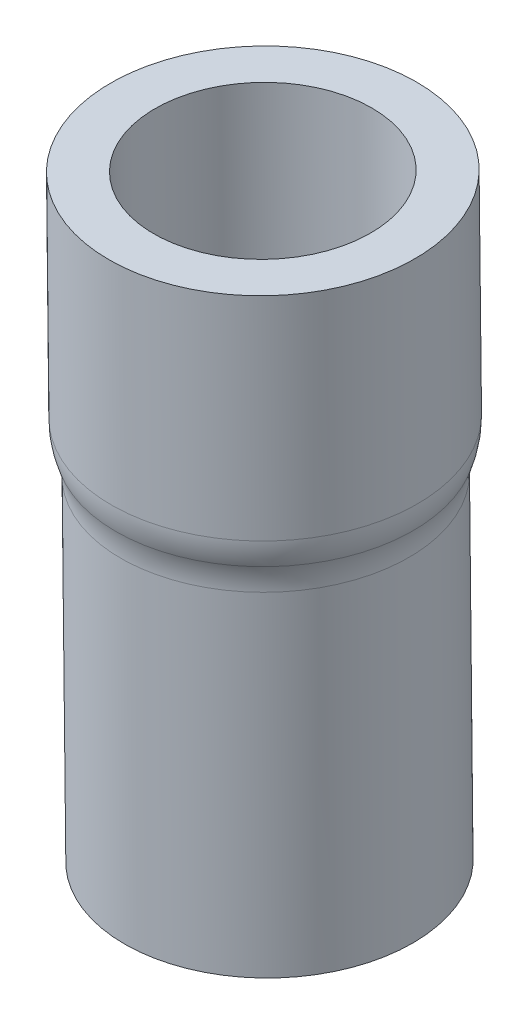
ISO-10303-21;
HEADER;
FILE_DESCRIPTION(('STEP AP214'),'2;1');
FILE_NAME('part.step','',(''),(''),'','','');
FILE_SCHEMA(('AUTOMOTIVE_DESIGN { 1 0 10303 214 1 1 1 1 }'));
ENDSEC;
DATA;
#1=APPLICATION_CONTEXT('core data for automotive mechanical design processes');
#2=APPLICATION_PROTOCOL_DEFINITION('international standard','automotive_design',2000,#1);
#3=PRODUCT_CONTEXT('',#1,'mechanical');
#4=PRODUCT('Part','Part','',(#3));
#5=PRODUCT_RELATED_PRODUCT_CATEGORY('part','',(#4));
#6=PRODUCT_DEFINITION_FORMATION('','',#4);
#7=PRODUCT_DEFINITION_CONTEXT('part definition',#1,'design');
#8=PRODUCT_DEFINITION('design','',#6,#7);
#9=PRODUCT_DEFINITION_SHAPE('','',#8);
#10=(LENGTH_UNIT() NAMED_UNIT(*) SI_UNIT(.MILLI.,.METRE.));
#11=(NAMED_UNIT(*) PLANE_ANGLE_UNIT() SI_UNIT($,.RADIAN.));
#12=(NAMED_UNIT(*) SI_UNIT($,.STERADIAN.) SOLID_ANGLE_UNIT());
#13=UNCERTAINTY_MEASURE_WITH_UNIT(LENGTH_MEASURE(1.E-05),#10,'distance_accuracy_value','');
#14=(GEOMETRIC_REPRESENTATION_CONTEXT(3) GLOBAL_UNCERTAINTY_ASSIGNED_CONTEXT((#13)) GLOBAL_UNIT_ASSIGNED_CONTEXT((#10,
#11,#12)) REPRESENTATION_CONTEXT('',''));
#15=CARTESIAN_POINT('',(0.,0.,0.));
#16=DIRECTION('',(0.,0.,1.));
#17=DIRECTION('',(1.,0.,0.));
#18=AXIS2_PLACEMENT_3D('',#15,#16,#17);
#19=CARTESIAN_POINT('',(80.8731987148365,-179.12525295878,-478.316633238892));
#20=DIRECTION('',(0.00555791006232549,-0.999969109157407,-0.00555791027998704));
#21=DIRECTION('',(0.,0.00555799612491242,-0.999984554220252));
#22=AXIS2_PLACEMENT_3D('',#19,#20,#21);
#23=CYLINDRICAL_SURFACE('',#22,2.4271478);
#24=CARTESIAN_POINT('',(80.7989120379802,-165.759728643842,-478.242346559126));
#25=DIRECTION('',(0.00555791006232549,-0.999969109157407,-0.00555791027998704));
#26=DIRECTION('',(0.,0.00555799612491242,-0.999984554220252));
#27=AXIS2_PLACEMENT_3D('',#24,#25,#26);
#28=CIRCLE('',#27,2.4271478);
#29=CARTESIAN_POINT('',(80.7989120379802,-165.746238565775,-480.669456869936));
#30=VERTEX_POINT('',#29);
#31=EDGE_CURVE('E18',#30,#30,#28,.F.);
#32=ORIENTED_EDGE('',*,*,#31,.T.);
#33=EDGE_LOOP('',(#32));
#34=FACE_BOUND('',#33,.T.);
#35=CARTESIAN_POINT('',(80.8253373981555,-170.514131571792,-478.268771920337));
#36=DIRECTION('',(0.00555791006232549,-0.999969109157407,-0.00555791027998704));
#37=DIRECTION('',(0.707084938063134,0.00786007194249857,-0.707084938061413));
#38=AXIS2_PLACEMENT_3D('',#35,#36,#37);
#39=CIRCLE('',#38,2.4271478);
#40=CARTESIAN_POINT('',(82.5415370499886,-170.495054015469,-479.984971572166));
#41=VERTEX_POINT('',#40);
#42=EDGE_CURVE('E31',#41,#41,#39,.T.);
#43=ORIENTED_EDGE('',*,*,#42,.T.);
#44=EDGE_LOOP('',(#43));
#45=FACE_BOUND('',#44,.T.);
#46=ADVANCED_FACE('F15',(#34,#45),#23,.F.);
#47=CARTESIAN_POINT('',(82.5151116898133,-165.740651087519,-479.958546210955));
#48=DIRECTION('',(0.00555791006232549,-0.999969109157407,-0.00555791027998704));
#49=DIRECTION('',(0.,0.00555799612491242,-0.999984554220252));
#50=AXIS2_PLACEMENT_3D('',#47,#48,#49);
#51=PLANE('',#50);
#52=ORIENTED_EDGE('',*,*,#31,.F.);
#53=EDGE_LOOP('',(#52));
#54=FACE_BOUND('',#53,.T.);
#55=CARTESIAN_POINT('',(80.7989120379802,-165.759728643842,-478.242346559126));
#56=DIRECTION('',(0.00555791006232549,-0.999969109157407,-0.00555791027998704));
#57=DIRECTION('',(0.,0.00555799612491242,-0.999984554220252));
#58=AXIS2_PLACEMENT_3D('',#55,#56,#57);
#59=CIRCLE('',#58,3.4246058);
#60=CARTESIAN_POINT('',(80.7989120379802,-165.740694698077,-481.66689946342));
#61=VERTEX_POINT('',#60);
#62=EDGE_CURVE('E35',#61,#61,#59,.T.);
#63=ORIENTED_EDGE('',*,*,#62,.F.);
#64=EDGE_LOOP('',(#63));
#65=FACE_BOUND('',#64,.T.);
#66=ADVANCED_FACE('F50',(#54,#65),#51,.F.);
#67=CARTESIAN_POINT('',(80.8253373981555,-170.514131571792,-478.268771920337));
#68=DIRECTION('',(0.00555791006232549,-0.999969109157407,-0.00555791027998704));
#69=DIRECTION('',(0.707084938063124,0.00786007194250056,-0.707084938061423));
#70=AXIS2_PLACEMENT_3D('',#67,#68,#69);
#71=TOROIDAL_SURFACE('',#70,1.76217580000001,0.664972);
#72=ORIENTED_EDGE('',*,*,#42,.F.);
#73=EDGE_LOOP('',(#72));
#74=FACE_BOUND('',#73,.T.);
#75=CARTESIAN_POINT('',(80.8265983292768,-170.74099601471,-478.270032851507));
#76=DIRECTION('',(0.00555791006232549,-0.999969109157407,-0.00555791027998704));
#77=DIRECTION('',(0.707084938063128,0.00786007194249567,-0.707084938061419));
#78=AXIS2_PLACEMENT_3D('',#75,#76,#77);
#79=CIRCLE('',#78,2.38724948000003);
#80=CARTESIAN_POINT('',(82.5145864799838,-170.722232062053,-479.95802100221));
#81=VERTEX_POINT('',#80);
#82=EDGE_CURVE('E37',#81,#81,#79,.F.);
#83=ORIENTED_EDGE('',*,*,#82,.F.);
#84=EDGE_LOOP('',(#83));
#85=FACE_BOUND('',#84,.T.);
#86=ADVANCED_FACE('F53',(#74,#85),#71,.F.);
#87=CARTESIAN_POINT('',(80.8731987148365,-179.12525295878,-478.316633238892));
#88=DIRECTION('',(0.00555791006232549,-0.999969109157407,-0.00555791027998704));
#89=DIRECTION('',(0.,0.00555799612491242,-0.999984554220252));
#90=AXIS2_PLACEMENT_3D('',#87,#88,#89);
#91=CYLINDRICAL_SURFACE('',#90,3.4246058);
#92=ORIENTED_EDGE('',*,*,#62,.T.);
#93=EDGE_LOOP('',(#92));
#94=FACE_BOUND('',#93,.T.);
#95=CARTESIAN_POINT('',(80.8253373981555,-170.514131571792,-478.268771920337));
#96=DIRECTION('',(0.00555791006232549,-0.999969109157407,-0.00555791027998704));
#97=DIRECTION('',(0.707084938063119,0.00786007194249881,-0.707084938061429));
#98=AXIS2_PLACEMENT_3D('',#95,#96,#97);
#99=CIRCLE('',#98,3.4246058);
#100=CARTESIAN_POINT('',(83.2468245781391,-170.487213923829,-480.690259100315));
#101=VERTEX_POINT('',#100);
#102=EDGE_CURVE('E41',#101,#101,#99,.T.);
#103=ORIENTED_EDGE('',*,*,#102,.F.);
#104=EDGE_LOOP('',(#103));
#105=FACE_BOUND('',#104,.T.);
#106=ADVANCED_FACE('F59',(#94,#105),#91,.T.);
#107=CARTESIAN_POINT('',(80.831642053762,-171.648453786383,-478.27507657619));
#108=DIRECTION('',(0.00555791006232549,-0.999969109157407,-0.00555791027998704));
#109=DIRECTION('',(0.707084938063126,0.00786007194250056,-0.707084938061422));
#110=AXIS2_PLACEMENT_3D('',#107,#108,#109);
#111=TOROIDAL_SURFACE('',#110,4.8875442,2.659888);
#112=ORIENTED_EDGE('',*,*,#82,.T.);
#113=EDGE_LOOP('',(#112));
#114=FACE_BOUND('',#113,.T.);
#115=CARTESIAN_POINT('',(80.831642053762,-171.648453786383,-478.27507657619));
#116=DIRECTION('',(0.00555791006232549,-0.999969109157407,-0.00555791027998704));
#117=DIRECTION('',(0.,0.00555799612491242,-0.999984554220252));
#118=AXIS2_PLACEMENT_3D('',#115,#116,#117);
#119=CIRCLE('',#118,2.2276562);
#120=CARTESIAN_POINT('',(80.831642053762,-171.636072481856,-480.502698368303));
#121=VERTEX_POINT('',#120);
#122=EDGE_CURVE('E84',#121,#121,#119,.T.);
#123=ORIENTED_EDGE('',*,*,#122,.T.);
#124=EDGE_LOOP('',(#123));
#125=FACE_BOUND('',#124,.T.);
#126=ADVANCED_FACE('F91',(#114,#125),#111,.T.);
#127=CARTESIAN_POINT('',(80.8253373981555,-170.514131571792,-478.268771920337));
#128=DIRECTION('',(0.00555791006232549,-0.999969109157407,-0.00555791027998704));
#129=DIRECTION('',(0.70708493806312,0.00786007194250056,-0.707084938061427));
#130=AXIS2_PLACEMENT_3D('',#127,#128,#129);
#131=TOROIDAL_SURFACE('',#130,1.7621758,1.66243);
#132=ORIENTED_EDGE('',*,*,#102,.T.);
#133=EDGE_LOOP('',(#132));
#134=FACE_BOUND('',#133,.T.);
#135=CARTESIAN_POINT('',(80.8284897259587,-171.081292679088,-478.271924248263));
#136=DIRECTION('',(0.00555791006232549,-0.999969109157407,-0.00555791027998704));
#137=DIRECTION('',(0.707084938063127,0.00786007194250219,-0.70708493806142));
#138=AXIS2_PLACEMENT_3D('',#135,#136,#137);
#139=CIRCLE('',#138,3.32485999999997);
#140=CARTESIAN_POINT('',(83.1794481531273,-171.055159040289,-480.622882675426));
#141=VERTEX_POINT('',#140);
#142=EDGE_CURVE('E34',#141,#141,#139,.F.);
#143=ORIENTED_EDGE('',*,*,#142,.T.);
#144=EDGE_LOOP('',(#143));
#145=FACE_BOUND('',#144,.T.);
#146=ADVANCED_FACE('F88',(#134,#145),#131,.T.);
#147=CARTESIAN_POINT('',(80.8731987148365,-179.12525295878,-478.316633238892));
#148=DIRECTION('',(0.00555791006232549,-0.999969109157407,-0.00555791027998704));
#149=DIRECTION('',(0.,0.00555799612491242,-0.999984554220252));
#150=AXIS2_PLACEMENT_3D('',#147,#148,#149);
#151=CYLINDRICAL_SURFACE('',#150,2.2276562);
#152=ORIENTED_EDGE('',*,*,#122,.F.);
#153=EDGE_LOOP('',(#152));
#154=FACE_BOUND('',#153,.T.);
#155=CARTESIAN_POINT('',(80.8731987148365,-179.12525295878,-478.316633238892));
#156=DIRECTION('',(0.00555791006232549,-0.999969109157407,-0.00555791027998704));
#157=DIRECTION('',(0.,0.00555799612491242,-0.999984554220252));
#158=AXIS2_PLACEMENT_3D('',#155,#156,#157);
#159=CIRCLE('',#158,2.2276562);
#160=CARTESIAN_POINT('',(80.8731987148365,-179.112871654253,-480.544255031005));
#161=VERTEX_POINT('',#160);
#162=EDGE_CURVE('E27',#161,#161,#159,.T.);
#163=ORIENTED_EDGE('',*,*,#162,.T.);
#164=EDGE_LOOP('',(#163));
#165=FACE_BOUND('',#164,.T.);
#166=ADVANCED_FACE('F77',(#154,#165),#151,.F.);
#167=CARTESIAN_POINT('',(80.831642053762,-171.648453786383,-478.27507657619));
#168=DIRECTION('',(0.00555791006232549,-0.999969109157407,-0.00555791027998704));
#169=DIRECTION('',(0.707084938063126,0.00786007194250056,-0.707084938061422));
#170=AXIS2_PLACEMENT_3D('',#167,#168,#169);
#171=TOROIDAL_SURFACE('',#170,4.8875442,1.66243);
#172=ORIENTED_EDGE('',*,*,#142,.F.);
#173=EDGE_LOOP('',(#172));
#174=FACE_BOUND('',#173,.T.);
#175=CARTESIAN_POINT('',(80.831642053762,-171.648453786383,-478.27507657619));
#176=DIRECTION('',(0.00555791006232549,-0.999969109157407,-0.00555791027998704));
#177=DIRECTION('',(0.,0.00555799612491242,-0.999984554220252));
#178=AXIS2_PLACEMENT_3D('',#175,#176,#177);
#179=CIRCLE('',#178,3.2251142);
#180=CARTESIAN_POINT('',(80.831642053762,-171.630528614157,-481.500140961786));
#181=VERTEX_POINT('',#180);
#182=EDGE_CURVE('E22',#181,#181,#179,.T.);
#183=ORIENTED_EDGE('',*,*,#182,.F.);
#184=EDGE_LOOP('',(#183));
#185=FACE_BOUND('',#184,.T.);
#186=ADVANCED_FACE('F70',(#174,#185),#171,.F.);
#187=CARTESIAN_POINT('',(83.15362838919,-179.099903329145,-480.59706291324));
#188=DIRECTION('',(-0.00555791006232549,0.999969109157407,0.00555791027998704));
#189=DIRECTION('',(0.,-0.00555799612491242,0.999984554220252));
#190=AXIS2_PLACEMENT_3D('',#187,#188,#189);
#191=PLANE('',#190);
#192=ORIENTED_EDGE('',*,*,#162,.F.);
#193=EDGE_LOOP('',(#192));
#194=FACE_BOUND('',#193,.T.);
#195=CARTESIAN_POINT('',(80.8731987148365,-179.12525295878,-478.316633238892));
#196=DIRECTION('',(0.00555791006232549,-0.999969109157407,-0.00555791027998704));
#197=DIRECTION('',(0.,0.00555799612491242,-0.999984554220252));
#198=AXIS2_PLACEMENT_3D('',#195,#196,#197);
#199=CIRCLE('',#198,3.2251142);
#200=CARTESIAN_POINT('',(80.8731987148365,-179.107327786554,-481.541697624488));
#201=VERTEX_POINT('',#200);
#202=EDGE_CURVE('E10',#201,#201,#199,.F.);
#203=ORIENTED_EDGE('',*,*,#202,.F.);
#204=EDGE_LOOP('',(#203));
#205=FACE_BOUND('',#204,.T.);
#206=ADVANCED_FACE('F64',(#194,#205),#191,.F.);
#207=CARTESIAN_POINT('',(80.8731987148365,-179.12525295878,-478.316633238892));
#208=DIRECTION('',(0.00555791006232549,-0.999969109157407,-0.00555791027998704));
#209=DIRECTION('',(0.,0.00555799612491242,-0.999984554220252));
#210=AXIS2_PLACEMENT_3D('',#207,#208,#209);
#211=CYLINDRICAL_SURFACE('',#210,3.2251142);
#212=ORIENTED_EDGE('',*,*,#182,.T.);
#213=EDGE_LOOP('',(#212));
#214=FACE_BOUND('',#213,.T.);
#215=ORIENTED_EDGE('',*,*,#202,.T.);
#216=EDGE_LOOP('',(#215));
#217=FACE_BOUND('',#216,.T.);
#218=ADVANCED_FACE('F62',(#214,#217),#211,.T.);
#219=CLOSED_SHELL('',(#46,#66,#86,#106,#126,#146,#166,#186,#206,#218));
#220=MANIFOLD_SOLID_BREP('B1',#219);
#221=ADVANCED_BREP_SHAPE_REPRESENTATION('',(#18,#220),#14);
#222=SHAPE_DEFINITION_REPRESENTATION(#9,#221);
ENDSEC;
END-ISO-10303-21;
